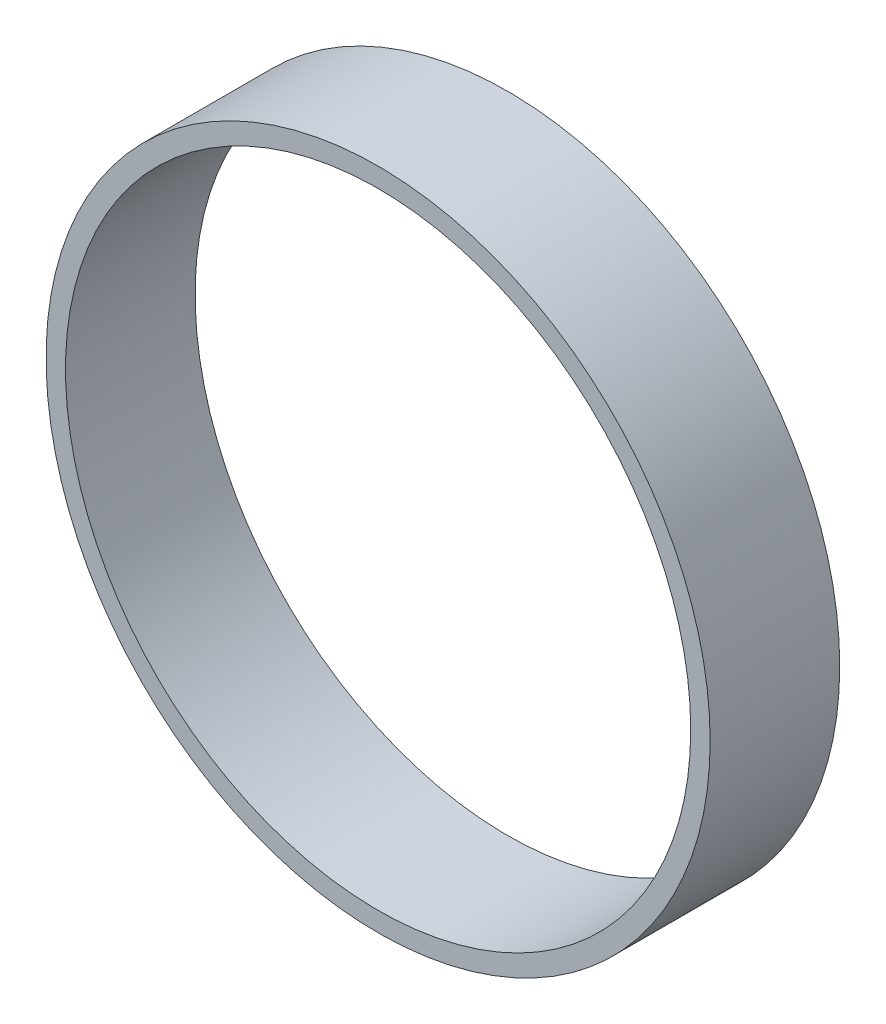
from build123d import *

# Parameters (mm, degrees)
SKETCH2_R           = 26.035
SKETCH2_R_2         = 24.511
BOSS_EXTRUDE1_DEPTH = 10.16


with BuildPart() as part:
    # Sketch2 → Boss-Extrude1 (new body)
    with BuildSketch(Plane.XY):
        Circle(SKETCH2_R)
        Circle(SKETCH2_R_2, mode=Mode.SUBTRACT)
    extrude(amount=-BOSS_EXTRUDE1_DEPTH)


solid = part.part
